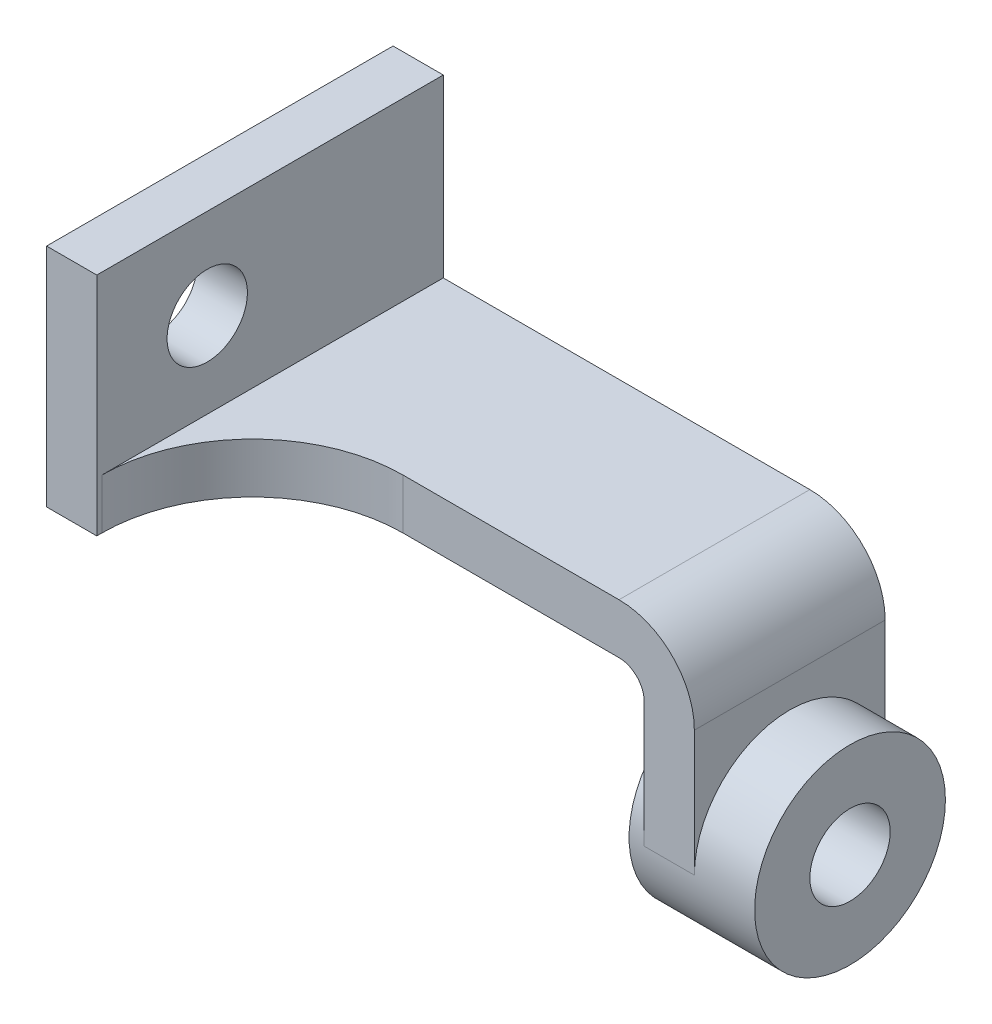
ISO-10303-21;
HEADER;
FILE_DESCRIPTION(('STEP AP214'),'2;1');
FILE_NAME('part.step','',(''),(''),'','','');
FILE_SCHEMA(('AUTOMOTIVE_DESIGN { 1 0 10303 214 1 1 1 1 }'));
ENDSEC;
DATA;
#1=APPLICATION_CONTEXT('core data for automotive mechanical design processes');
#2=APPLICATION_PROTOCOL_DEFINITION('international standard','automotive_design',2000,#1);
#3=PRODUCT_CONTEXT('',#1,'mechanical');
#4=PRODUCT('Part','Part','',(#3));
#5=PRODUCT_RELATED_PRODUCT_CATEGORY('part','',(#4));
#6=PRODUCT_DEFINITION_FORMATION('','',#4);
#7=PRODUCT_DEFINITION_CONTEXT('part definition',#1,'design');
#8=PRODUCT_DEFINITION('design','',#6,#7);
#9=PRODUCT_DEFINITION_SHAPE('','',#8);
#10=(LENGTH_UNIT() NAMED_UNIT(*) SI_UNIT(.MILLI.,.METRE.));
#11=(NAMED_UNIT(*) PLANE_ANGLE_UNIT() SI_UNIT($,.RADIAN.));
#12=(NAMED_UNIT(*) SI_UNIT($,.STERADIAN.) SOLID_ANGLE_UNIT());
#13=UNCERTAINTY_MEASURE_WITH_UNIT(LENGTH_MEASURE(1.E-05),#10,'distance_accuracy_value','');
#14=(GEOMETRIC_REPRESENTATION_CONTEXT(3) GLOBAL_UNCERTAINTY_ASSIGNED_CONTEXT((#13)) GLOBAL_UNIT_ASSIGNED_CONTEXT((#10,
#11,#12)) REPRESENTATION_CONTEXT('',''));
#15=CARTESIAN_POINT('',(0.,0.,0.));
#16=DIRECTION('',(0.,0.,1.));
#17=DIRECTION('',(1.,0.,0.));
#18=AXIS2_PLACEMENT_3D('',#15,#16,#17);
#19=CARTESIAN_POINT('',(88.,-22.5,19.));
#20=DIRECTION('',(1.,0.,0.));
#21=DIRECTION('',(0.,0.,-1.));
#22=AXIS2_PLACEMENT_3D('',#19,#20,#21);
#23=PLANE('',#22);
#24=DIRECTION('',(0.,-1.,0.));
#25=VECTOR('',#24,1.);
#26=CARTESIAN_POINT('',(88.,-22.5,19.));
#27=LINE('',#26,#25);
#28=CARTESIAN_POINT('',(88.,-27.5,19.));
#29=VERTEX_POINT('',#28);
#30=CARTESIAN_POINT('',(88.,-52.5,19.));
#31=VERTEX_POINT('',#30);
#32=EDGE_CURVE('E114',#29,#31,#27,.T.);
#33=ORIENTED_EDGE('',*,*,#32,.F.);
#34=DIRECTION('',(0.,0.,-1.));
#35=VECTOR('',#34,1.);
#36=CARTESIAN_POINT('',(88.,-27.5,-19.));
#37=LINE('',#36,#35);
#38=CARTESIAN_POINT('',(88.,-27.5,-19.));
#39=VERTEX_POINT('',#38);
#40=EDGE_CURVE('E183',#29,#39,#37,.T.);
#41=ORIENTED_EDGE('',*,*,#40,.T.);
#42=DIRECTION('',(0.,-1.,0.));
#43=VECTOR('',#42,1.);
#44=CARTESIAN_POINT('',(88.,-22.5,-19.));
#45=LINE('',#44,#43);
#46=CARTESIAN_POINT('',(88.,-52.5,-19.));
#47=VERTEX_POINT('',#46);
#48=EDGE_CURVE('E136',#39,#47,#45,.T.);
#49=ORIENTED_EDGE('',*,*,#48,.T.);
#50=CARTESIAN_POINT('',(88.,-52.5,0.));
#51=DIRECTION('',(1.,0.,0.));
#52=DIRECTION('',(0.,0.,-1.));
#53=AXIS2_PLACEMENT_3D('',#50,#51,#52);
#54=CIRCLE('',#53,19.);
#55=EDGE_CURVE('E130',#31,#47,#54,.F.);
#56=ORIENTED_EDGE('',*,*,#55,.F.);
#57=EDGE_LOOP('',(#33,#41,#49,#56));
#58=FACE_BOUND('',#57,.T.);
#59=ADVANCED_FACE('F26',(#58),#23,.F.);
#60=CARTESIAN_POINT('',(98.,-12.5,19.));
#61=DIRECTION('',(-1.,0.,0.));
#62=DIRECTION('',(0.,0.,1.));
#63=AXIS2_PLACEMENT_3D('',#60,#61,#62);
#64=PLANE('',#63);
#65=DIRECTION('',(0.,1.,0.));
#66=VECTOR('',#65,1.);
#67=CARTESIAN_POINT('',(98.,-12.5,-19.));
#68=LINE('',#67,#66);
#69=CARTESIAN_POINT('',(98.,-52.5,-19.));
#70=VERTEX_POINT('',#69);
#71=CARTESIAN_POINT('',(98.,-27.5,-19.));
#72=VERTEX_POINT('',#71);
#73=EDGE_CURVE('E145',#70,#72,#68,.T.);
#74=ORIENTED_EDGE('',*,*,#73,.T.);
#75=DIRECTION('',(0.,0.,-1.));
#76=VECTOR('',#75,1.);
#77=CARTESIAN_POINT('',(98.,-27.5,19.));
#78=LINE('',#77,#76);
#79=CARTESIAN_POINT('',(98.,-27.5,19.));
#80=VERTEX_POINT('',#79);
#81=EDGE_CURVE('E179',#72,#80,#78,.F.);
#82=ORIENTED_EDGE('',*,*,#81,.T.);
#83=DIRECTION('',(0.,1.,0.));
#84=VECTOR('',#83,1.);
#85=CARTESIAN_POINT('',(98.,-12.5,19.));
#86=LINE('',#85,#84);
#87=CARTESIAN_POINT('',(98.,-52.5,19.));
#88=VERTEX_POINT('',#87);
#89=EDGE_CURVE('E134',#88,#80,#86,.T.);
#90=ORIENTED_EDGE('',*,*,#89,.F.);
#91=CARTESIAN_POINT('',(98.,-52.5,0.));
#92=DIRECTION('',(-1.,0.,0.));
#93=DIRECTION('',(0.,0.,1.));
#94=AXIS2_PLACEMENT_3D('',#91,#92,#93);
#95=CIRCLE('',#94,19.);
#96=EDGE_CURVE('E133',#70,#88,#95,.F.);
#97=ORIENTED_EDGE('',*,*,#96,.F.);
#98=EDGE_LOOP('',(#74,#82,#90,#97));
#99=FACE_BOUND('',#98,.T.);
#100=ADVANCED_FACE('F190',(#99),#64,.F.);
#101=CARTESIAN_POINT('',(10.,22.5,50.));
#102=DIRECTION('',(-1.,0.,0.));
#103=DIRECTION('',(0.,0.,1.));
#104=AXIS2_PLACEMENT_3D('',#101,#102,#103);
#105=PLANE('',#104);
#106=CARTESIAN_POINT('',(10.,4.5,28.));
#107=DIRECTION('',(1.,0.,0.));
#108=DIRECTION('',(0.,0.,-1.));
#109=AXIS2_PLACEMENT_3D('',#106,#107,#108);
#110=CIRCLE('',#109,8.);
#111=CARTESIAN_POINT('',(10.,4.5,20.));
#112=VERTEX_POINT('',#111);
#113=EDGE_CURVE('E388',#112,#112,#110,.T.);
#114=ORIENTED_EDGE('',*,*,#113,.F.);
#115=EDGE_LOOP('',(#114));
#116=FACE_BOUND('',#115,.T.);
#117=DIRECTION('',(0.,0.,-1.));
#118=VECTOR('',#117,1.);
#119=CARTESIAN_POINT('',(10.,-22.5,50.));
#120=LINE('',#119,#118);
#121=CARTESIAN_POINT('',(10.,-22.5,50.));
#122=VERTEX_POINT('',#121);
#123=CARTESIAN_POINT('',(10.,-22.5,49.));
#124=VERTEX_POINT('',#123);
#125=EDGE_CURVE('E207',#122,#124,#120,.T.);
#126=ORIENTED_EDGE('',*,*,#125,.T.);
#127=DIRECTION('',(0.,-1.,0.));
#128=VECTOR('',#127,1.);
#129=CARTESIAN_POINT('',(10.,-12.5,49.));
#130=LINE('',#129,#128);
#131=CARTESIAN_POINT('',(10.,-12.5,49.));
#132=VERTEX_POINT('',#131);
#133=EDGE_CURVE('E234',#124,#132,#130,.F.);
#134=ORIENTED_EDGE('',*,*,#133,.T.);
#135=DIRECTION('',(0.,0.,-1.));
#136=VECTOR('',#135,1.);
#137=CARTESIAN_POINT('',(10.,-12.5,19.));
#138=LINE('',#137,#136);
#139=CARTESIAN_POINT('',(10.,-12.5,-19.));
#140=VERTEX_POINT('',#139);
#141=EDGE_CURVE('E152',#132,#140,#138,.T.);
#142=ORIENTED_EDGE('',*,*,#141,.T.);
#143=DIRECTION('',(0.,1.,0.));
#144=VECTOR('',#143,1.);
#145=CARTESIAN_POINT('',(10.,-22.5,-19.));
#146=LINE('',#145,#144);
#147=CARTESIAN_POINT('',(10.,22.5,-19.));
#148=VERTEX_POINT('',#147);
#149=EDGE_CURVE('E161',#140,#148,#146,.T.);
#150=ORIENTED_EDGE('',*,*,#149,.T.);
#151=DIRECTION('',(0.,0.,1.));
#152=VECTOR('',#151,1.);
#153=CARTESIAN_POINT('',(10.,22.5,50.));
#154=LINE('',#153,#152);
#155=CARTESIAN_POINT('',(10.,22.5,50.));
#156=VERTEX_POINT('',#155);
#157=EDGE_CURVE('E206',#148,#156,#154,.T.);
#158=ORIENTED_EDGE('',*,*,#157,.T.);
#159=DIRECTION('',(0.,-1.,0.));
#160=VECTOR('',#159,1.);
#161=CARTESIAN_POINT('',(10.,-22.5,50.));
#162=LINE('',#161,#160);
#163=EDGE_CURVE('E211',#156,#122,#162,.T.);
#164=ORIENTED_EDGE('',*,*,#163,.T.);
#165=EDGE_LOOP('',(#126,#134,#142,#150,#158,#164));
#166=FACE_BOUND('',#165,.T.);
#167=ADVANCED_FACE('F259',(#116,#166),#105,.F.);
#168=CARTESIAN_POINT('',(10.,-22.5,50.));
#169=DIRECTION('',(0.,0.,-1.));
#170=DIRECTION('',(-1.,0.,0.));
#171=AXIS2_PLACEMENT_3D('',#168,#169,#170);
#172=PLANE('',#171);
#173=DIRECTION('',(0.,-1.,0.));
#174=VECTOR('',#173,1.);
#175=CARTESIAN_POINT('',(0.,-22.5,50.));
#176=LINE('',#175,#174);
#177=CARTESIAN_POINT('',(0.,22.5,50.));
#178=VERTEX_POINT('',#177);
#179=CARTESIAN_POINT('',(0.,-22.5,50.));
#180=VERTEX_POINT('',#179);
#181=EDGE_CURVE('E155',#178,#180,#176,.T.);
#182=ORIENTED_EDGE('',*,*,#181,.T.);
#183=DIRECTION('',(-1.,0.,0.));
#184=VECTOR('',#183,1.);
#185=CARTESIAN_POINT('',(10.,-22.5,50.));
#186=LINE('',#185,#184);
#187=EDGE_CURVE('E219',#122,#180,#186,.T.);
#188=ORIENTED_EDGE('',*,*,#187,.F.);
#189=ORIENTED_EDGE('',*,*,#163,.F.);
#190=DIRECTION('',(-1.,0.,0.));
#191=VECTOR('',#190,1.);
#192=CARTESIAN_POINT('',(10.,22.5,50.));
#193=LINE('',#192,#191);
#194=EDGE_CURVE('E208',#156,#178,#193,.T.);
#195=ORIENTED_EDGE('',*,*,#194,.T.);
#196=EDGE_LOOP('',(#182,#188,#189,#195));
#197=FACE_BOUND('',#196,.T.);
#198=ADVANCED_FACE('F28',(#197),#172,.F.);
#199=CARTESIAN_POINT('',(10.,-22.5,50.));
#200=DIRECTION('',(0.,1.,0.));
#201=DIRECTION('',(0.,0.,1.));
#202=AXIS2_PLACEMENT_3D('',#199,#200,#201);
#203=PLANE('',#202);
#204=DIRECTION('',(-1.,0.,0.));
#205=VECTOR('',#204,1.);
#206=CARTESIAN_POINT('',(10.,-22.5,-19.));
#207=LINE('',#206,#205);
#208=CARTESIAN_POINT('',(83.,-22.5,-19.));
#209=VERTEX_POINT('',#208);
#210=CARTESIAN_POINT('',(0.,-22.5,-19.));
#211=VERTEX_POINT('',#210);
#212=EDGE_CURVE('E227',#209,#211,#207,.T.);
#213=ORIENTED_EDGE('',*,*,#212,.F.);
#214=DIRECTION('',(0.,0.,-1.));
#215=VECTOR('',#214,1.);
#216=CARTESIAN_POINT('',(83.,-22.5,19.));
#217=LINE('',#216,#215);
#218=CARTESIAN_POINT('',(83.,-22.5,19.));
#219=VERTEX_POINT('',#218);
#220=EDGE_CURVE('E41',#209,#219,#217,.F.);
#221=ORIENTED_EDGE('',*,*,#220,.T.);
#222=DIRECTION('',(1.,0.,0.));
#223=VECTOR('',#222,1.);
#224=CARTESIAN_POINT('',(10.,-22.5,19.));
#225=LINE('',#224,#223);
#226=CARTESIAN_POINT('',(40.,-22.5,19.));
#227=VERTEX_POINT('',#226);
#228=EDGE_CURVE('E125',#227,#219,#225,.T.);
#229=ORIENTED_EDGE('',*,*,#228,.F.);
#230=CARTESIAN_POINT('',(40.,-22.5,49.));
#231=DIRECTION('',(0.,1.,0.));
#232=DIRECTION('',(0.,0.,1.));
#233=AXIS2_PLACEMENT_3D('',#230,#231,#232);
#234=CIRCLE('',#233,30.);
#235=EDGE_CURVE('E237',#227,#124,#234,.T.);
#236=ORIENTED_EDGE('',*,*,#235,.T.);
#237=ORIENTED_EDGE('',*,*,#125,.F.);
#238=ORIENTED_EDGE('',*,*,#187,.T.);
#239=DIRECTION('',(0.,0.,-1.));
#240=VECTOR('',#239,1.);
#241=CARTESIAN_POINT('',(0.,-22.5,50.));
#242=LINE('',#241,#240);
#243=EDGE_CURVE('E286',#180,#211,#242,.T.);
#244=ORIENTED_EDGE('',*,*,#243,.T.);
#245=EDGE_LOOP('',(#213,#221,#229,#236,#237,#238,#244));
#246=FACE_BOUND('',#245,.T.);
#247=ADVANCED_FACE('F243',(#246),#203,.F.);
#248=CARTESIAN_POINT('',(10.,-22.5,-19.));
#249=DIRECTION('',(0.,0.,1.));
#250=DIRECTION('',(1.,0.,0.));
#251=AXIS2_PLACEMENT_3D('',#248,#249,#250);
#252=PLANE('',#251);
#253=DIRECTION('',(-1.,0.,0.));
#254=VECTOR('',#253,1.);
#255=CARTESIAN_POINT('',(10.,-12.5,-19.));
#256=LINE('',#255,#254);
#257=CARTESIAN_POINT('',(83.,-12.5,-19.));
#258=VERTEX_POINT('',#257);
#259=EDGE_CURVE('E147',#258,#140,#256,.T.);
#260=ORIENTED_EDGE('',*,*,#259,.F.);
#261=CARTESIAN_POINT('',(83.,-27.5,-19.));
#262=DIRECTION('',(0.,0.,1.));
#263=DIRECTION('',(1.,0.,0.));
#264=AXIS2_PLACEMENT_3D('',#261,#262,#263);
#265=CIRCLE('',#264,15.);
#266=EDGE_CURVE('E176',#258,#72,#265,.F.);
#267=ORIENTED_EDGE('',*,*,#266,.T.);
#268=ORIENTED_EDGE('',*,*,#73,.F.);
#269=DIRECTION('',(1.,0.,0.));
#270=VECTOR('',#269,1.);
#271=CARTESIAN_POINT('',(98.,-52.5,-19.));
#272=LINE('',#271,#270);
#273=EDGE_CURVE('E138',#47,#70,#272,.T.);
#274=ORIENTED_EDGE('',*,*,#273,.F.);
#275=ORIENTED_EDGE('',*,*,#48,.F.);
#276=CARTESIAN_POINT('',(83.,-27.5,-19.));
#277=DIRECTION('',(0.,0.,1.));
#278=DIRECTION('',(1.,0.,0.));
#279=AXIS2_PLACEMENT_3D('',#276,#277,#278);
#280=CIRCLE('',#279,5.);
#281=EDGE_CURVE('E34',#39,#209,#280,.T.);
#282=ORIENTED_EDGE('',*,*,#281,.T.);
#283=ORIENTED_EDGE('',*,*,#212,.T.);
#284=DIRECTION('',(0.,1.,0.));
#285=VECTOR('',#284,1.);
#286=CARTESIAN_POINT('',(0.,-22.5,-19.));
#287=LINE('',#286,#285);
#288=CARTESIAN_POINT('',(0.,22.5,-19.));
#289=VERTEX_POINT('',#288);
#290=EDGE_CURVE('E287',#211,#289,#287,.T.);
#291=ORIENTED_EDGE('',*,*,#290,.T.);
#292=DIRECTION('',(-1.,0.,0.));
#293=VECTOR('',#292,1.);
#294=CARTESIAN_POINT('',(10.,22.5,-19.));
#295=LINE('',#294,#293);
#296=EDGE_CURVE('E203',#148,#289,#295,.T.);
#297=ORIENTED_EDGE('',*,*,#296,.F.);
#298=ORIENTED_EDGE('',*,*,#149,.F.);
#299=EDGE_LOOP('',(#260,#267,#268,#274,#275,#282,#283,#291,#297,#298));
#300=FACE_BOUND('',#299,.T.);
#301=ADVANCED_FACE('F187',(#300),#252,.F.);
#302=CARTESIAN_POINT('',(10.,22.5,50.));
#303=DIRECTION('',(0.,-1.,0.));
#304=DIRECTION('',(0.,0.,-1.));
#305=AXIS2_PLACEMENT_3D('',#302,#303,#304);
#306=PLANE('',#305);
#307=DIRECTION('',(0.,0.,1.));
#308=VECTOR('',#307,1.);
#309=CARTESIAN_POINT('',(0.,22.5,50.));
#310=LINE('',#309,#308);
#311=EDGE_CURVE('E215',#289,#178,#310,.T.);
#312=ORIENTED_EDGE('',*,*,#311,.T.);
#313=ORIENTED_EDGE('',*,*,#194,.F.);
#314=ORIENTED_EDGE('',*,*,#157,.F.);
#315=ORIENTED_EDGE('',*,*,#296,.T.);
#316=EDGE_LOOP('',(#312,#313,#314,#315));
#317=FACE_BOUND('',#316,.T.);
#318=ADVANCED_FACE('F266',(#317),#306,.F.);
#319=CARTESIAN_POINT('',(0.,22.5,50.));
#320=DIRECTION('',(-1.,0.,0.));
#321=DIRECTION('',(0.,0.,1.));
#322=AXIS2_PLACEMENT_3D('',#319,#320,#321);
#323=PLANE('',#322);
#324=CARTESIAN_POINT('',(0.,4.5,28.));
#325=DIRECTION('',(1.,0.,0.));
#326=DIRECTION('',(0.,0.,-1.));
#327=AXIS2_PLACEMENT_3D('',#324,#325,#326);
#328=CIRCLE('',#327,8.);
#329=CARTESIAN_POINT('',(0.,4.5,20.));
#330=VERTEX_POINT('',#329);
#331=EDGE_CURVE('E385',#330,#330,#328,.T.);
#332=ORIENTED_EDGE('',*,*,#331,.T.);
#333=EDGE_LOOP('',(#332));
#334=FACE_BOUND('',#333,.T.);
#335=ORIENTED_EDGE('',*,*,#181,.F.);
#336=ORIENTED_EDGE('',*,*,#311,.F.);
#337=ORIENTED_EDGE('',*,*,#290,.F.);
#338=ORIENTED_EDGE('',*,*,#243,.F.);
#339=EDGE_LOOP('',(#335,#336,#337,#338));
#340=FACE_BOUND('',#339,.T.);
#341=ADVANCED_FACE('F263',(#334,#340),#323,.T.);
#342=CARTESIAN_POINT('',(10.,-12.5,19.));
#343=DIRECTION('',(0.,-1.,0.));
#344=DIRECTION('',(0.,0.,-1.));
#345=AXIS2_PLACEMENT_3D('',#342,#343,#344);
#346=PLANE('',#345);
#347=DIRECTION('',(-1.,0.,0.));
#348=VECTOR('',#347,1.);
#349=CARTESIAN_POINT('',(10.,-12.5,19.));
#350=LINE('',#349,#348);
#351=CARTESIAN_POINT('',(83.,-12.5,19.));
#352=VERTEX_POINT('',#351);
#353=CARTESIAN_POINT('',(40.,-12.5,19.));
#354=VERTEX_POINT('',#353);
#355=EDGE_CURVE('E150',#352,#354,#350,.T.);
#356=ORIENTED_EDGE('',*,*,#355,.F.);
#357=DIRECTION('',(0.,0.,-1.));
#358=VECTOR('',#357,1.);
#359=CARTESIAN_POINT('',(83.,-12.5,19.));
#360=LINE('',#359,#358);
#361=EDGE_CURVE('E173',#352,#258,#360,.T.);
#362=ORIENTED_EDGE('',*,*,#361,.T.);
#363=ORIENTED_EDGE('',*,*,#259,.T.);
#364=ORIENTED_EDGE('',*,*,#141,.F.);
#365=CARTESIAN_POINT('',(40.,-12.5,49.));
#366=DIRECTION('',(0.,-1.,0.));
#367=DIRECTION('',(0.,0.,-1.));
#368=AXIS2_PLACEMENT_3D('',#365,#366,#367);
#369=CIRCLE('',#368,30.);
#370=EDGE_CURVE('E177',#132,#354,#369,.T.);
#371=ORIENTED_EDGE('',*,*,#370,.T.);
#372=EDGE_LOOP('',(#356,#362,#363,#364,#371));
#373=FACE_BOUND('',#372,.T.);
#374=ADVANCED_FACE('F198',(#373),#346,.F.);
#375=CARTESIAN_POINT('',(88.,-22.5,19.));
#376=DIRECTION('',(0.,0.,-1.));
#377=DIRECTION('',(-1.,0.,0.));
#378=AXIS2_PLACEMENT_3D('',#375,#376,#377);
#379=PLANE('',#378);
#380=ORIENTED_EDGE('',*,*,#89,.T.);
#381=CARTESIAN_POINT('',(83.,-27.5,19.));
#382=DIRECTION('',(0.,0.,-1.));
#383=DIRECTION('',(-1.,0.,0.));
#384=AXIS2_PLACEMENT_3D('',#381,#382,#383);
#385=CIRCLE('',#384,15.);
#386=EDGE_CURVE('E181',#80,#352,#385,.F.);
#387=ORIENTED_EDGE('',*,*,#386,.T.);
#388=ORIENTED_EDGE('',*,*,#355,.T.);
#389=DIRECTION('',(0.,-1.,0.));
#390=VECTOR('',#389,1.);
#391=CARTESIAN_POINT('',(40.,-22.5,19.));
#392=LINE('',#391,#390);
#393=EDGE_CURVE('E230',#354,#227,#392,.T.);
#394=ORIENTED_EDGE('',*,*,#393,.T.);
#395=ORIENTED_EDGE('',*,*,#228,.T.);
#396=CARTESIAN_POINT('',(83.,-27.5,19.));
#397=DIRECTION('',(0.,0.,-1.));
#398=DIRECTION('',(-1.,0.,0.));
#399=AXIS2_PLACEMENT_3D('',#396,#397,#398);
#400=CIRCLE('',#399,5.);
#401=EDGE_CURVE('E11',#219,#29,#400,.T.);
#402=ORIENTED_EDGE('',*,*,#401,.T.);
#403=ORIENTED_EDGE('',*,*,#32,.T.);
#404=DIRECTION('',(1.,0.,0.));
#405=VECTOR('',#404,1.);
#406=CARTESIAN_POINT('',(98.,-52.5,19.));
#407=LINE('',#406,#405);
#408=EDGE_CURVE('E118',#31,#88,#407,.T.);
#409=ORIENTED_EDGE('',*,*,#408,.T.);
#410=EDGE_LOOP('',(#380,#387,#388,#394,#395,#402,#403,#409));
#411=FACE_BOUND('',#410,.T.);
#412=ADVANCED_FACE('F117',(#411),#379,.F.);
#413=CARTESIAN_POINT('',(40.,-22.5,49.));
#414=DIRECTION('',(0.,1.,0.));
#415=DIRECTION('',(0.,0.,1.));
#416=AXIS2_PLACEMENT_3D('',#413,#414,#415);
#417=CYLINDRICAL_SURFACE('',#416,30.);
#418=ORIENTED_EDGE('',*,*,#370,.F.);
#419=ORIENTED_EDGE('',*,*,#133,.F.);
#420=ORIENTED_EDGE('',*,*,#235,.F.);
#421=ORIENTED_EDGE('',*,*,#393,.F.);
#422=EDGE_LOOP('',(#418,#419,#420,#421));
#423=FACE_BOUND('',#422,.T.);
#424=ADVANCED_FACE('F242',(#423),#417,.F.);
#425=CARTESIAN_POINT('',(110.,-52.5,0.));
#426=DIRECTION('',(-1.,0.,0.));
#427=DIRECTION('',(0.,0.,1.));
#428=AXIS2_PLACEMENT_3D('',#425,#426,#427);
#429=CYLINDRICAL_SURFACE('',#428,19.);
#430=CARTESIAN_POINT('',(85.,-52.5,0.));
#431=DIRECTION('',(1.,0.,0.));
#432=DIRECTION('',(0.,0.,-1.));
#433=AXIS2_PLACEMENT_3D('',#430,#431,#432);
#434=CIRCLE('',#433,19.);
#435=CARTESIAN_POINT('',(85.,-52.5,-19.));
#436=VERTEX_POINT('',#435);
#437=EDGE_CURVE('E395',#436,#436,#434,.T.);
#438=ORIENTED_EDGE('',*,*,#437,.T.);
#439=EDGE_LOOP('',(#438));
#440=FACE_BOUND('',#439,.T.);
#441=CARTESIAN_POINT('',(110.,-52.5,0.));
#442=DIRECTION('',(1.,0.,0.));
#443=DIRECTION('',(0.,0.,-1.));
#444=AXIS2_PLACEMENT_3D('',#441,#442,#443);
#445=CIRCLE('',#444,19.);
#446=CARTESIAN_POINT('',(110.,-52.5,-19.));
#447=VERTEX_POINT('',#446);
#448=EDGE_CURVE('E140',#447,#447,#445,.T.);
#449=ORIENTED_EDGE('',*,*,#448,.F.);
#450=EDGE_LOOP('',(#449));
#451=FACE_BOUND('',#450,.T.);
#452=ORIENTED_EDGE('',*,*,#408,.F.);
#453=ORIENTED_EDGE('',*,*,#55,.T.);
#454=ORIENTED_EDGE('',*,*,#273,.T.);
#455=ORIENTED_EDGE('',*,*,#96,.T.);
#456=EDGE_LOOP('',(#452,#453,#454,#455));
#457=FACE_BOUND('',#456,.T.);
#458=ADVANCED_FACE('F129',(#440,#451,#457),#429,.T.);
#459=CARTESIAN_POINT('',(110.,-52.5,0.));
#460=DIRECTION('',(1.,0.,0.));
#461=DIRECTION('',(0.,0.,-1.));
#462=AXIS2_PLACEMENT_3D('',#459,#460,#461);
#463=PLANE('',#462);
#464=CARTESIAN_POINT('',(110.,-52.5,0.));
#465=DIRECTION('',(1.,0.,0.));
#466=DIRECTION('',(0.,0.,-1.));
#467=AXIS2_PLACEMENT_3D('',#464,#465,#466);
#468=CIRCLE('',#467,8.);
#469=CARTESIAN_POINT('',(110.,-52.5,-8.));
#470=VERTEX_POINT('',#469);
#471=EDGE_CURVE('E390',#470,#470,#468,.T.);
#472=ORIENTED_EDGE('',*,*,#471,.F.);
#473=EDGE_LOOP('',(#472));
#474=FACE_BOUND('',#473,.T.);
#475=ORIENTED_EDGE('',*,*,#448,.T.);
#476=EDGE_LOOP('',(#475));
#477=FACE_BOUND('',#476,.T.);
#478=ADVANCED_FACE('F311',(#474,#477),#463,.T.);
#479=CARTESIAN_POINT('',(85.,-52.5,0.));
#480=DIRECTION('',(1.,0.,0.));
#481=DIRECTION('',(0.,0.,-1.));
#482=AXIS2_PLACEMENT_3D('',#479,#480,#481);
#483=PLANE('',#482);
#484=CARTESIAN_POINT('',(85.,-52.5,0.));
#485=DIRECTION('',(1.,0.,0.));
#486=DIRECTION('',(0.,0.,-1.));
#487=AXIS2_PLACEMENT_3D('',#484,#485,#486);
#488=CIRCLE('',#487,8.);
#489=CARTESIAN_POINT('',(85.,-52.5,-8.));
#490=VERTEX_POINT('',#489);
#491=EDGE_CURVE('E171',#490,#490,#488,.T.);
#492=ORIENTED_EDGE('',*,*,#491,.T.);
#493=EDGE_LOOP('',(#492));
#494=FACE_BOUND('',#493,.T.);
#495=ORIENTED_EDGE('',*,*,#437,.F.);
#496=EDGE_LOOP('',(#495));
#497=FACE_BOUND('',#496,.T.);
#498=ADVANCED_FACE('F319',(#494,#497),#483,.F.);
#499=CARTESIAN_POINT('',(0.,-52.5,0.));
#500=DIRECTION('',(1.,0.,0.));
#501=DIRECTION('',(0.,0.,-1.));
#502=AXIS2_PLACEMENT_3D('',#499,#500,#501);
#503=CYLINDRICAL_SURFACE('',#502,8.);
#504=ORIENTED_EDGE('',*,*,#471,.T.);
#505=EDGE_LOOP('',(#504));
#506=FACE_BOUND('',#505,.T.);
#507=ORIENTED_EDGE('',*,*,#491,.F.);
#508=EDGE_LOOP('',(#507));
#509=FACE_BOUND('',#508,.T.);
#510=ADVANCED_FACE('F327',(#506,#509),#503,.F.);
#511=CARTESIAN_POINT('',(0.,4.5,28.));
#512=DIRECTION('',(1.,0.,0.));
#513=DIRECTION('',(0.,0.,-1.));
#514=AXIS2_PLACEMENT_3D('',#511,#512,#513);
#515=CYLINDRICAL_SURFACE('',#514,8.);
#516=ORIENTED_EDGE('',*,*,#331,.F.);
#517=EDGE_LOOP('',(#516));
#518=FACE_BOUND('',#517,.T.);
#519=ORIENTED_EDGE('',*,*,#113,.T.);
#520=EDGE_LOOP('',(#519));
#521=FACE_BOUND('',#520,.T.);
#522=ADVANCED_FACE('F251',(#518,#521),#515,.F.);
#523=CARTESIAN_POINT('',(83.,-27.5,19.));
#524=DIRECTION('',(0.,0.,-1.));
#525=DIRECTION('',(-1.,0.,0.));
#526=AXIS2_PLACEMENT_3D('',#523,#524,#525);
#527=CYLINDRICAL_SURFACE('',#526,15.);
#528=ORIENTED_EDGE('',*,*,#386,.F.);
#529=ORIENTED_EDGE('',*,*,#81,.F.);
#530=ORIENTED_EDGE('',*,*,#266,.F.);
#531=ORIENTED_EDGE('',*,*,#361,.F.);
#532=EDGE_LOOP('',(#528,#529,#530,#531));
#533=FACE_BOUND('',#532,.T.);
#534=ADVANCED_FACE('F196',(#533),#527,.T.);
#535=CARTESIAN_POINT('',(83.,-27.5,19.));
#536=DIRECTION('',(0.,0.,1.));
#537=DIRECTION('',(1.,0.,0.));
#538=AXIS2_PLACEMENT_3D('',#535,#536,#537);
#539=CYLINDRICAL_SURFACE('',#538,5.);
#540=ORIENTED_EDGE('',*,*,#401,.F.);
#541=ORIENTED_EDGE('',*,*,#220,.F.);
#542=ORIENTED_EDGE('',*,*,#281,.F.);
#543=ORIENTED_EDGE('',*,*,#40,.F.);
#544=EDGE_LOOP('',(#540,#541,#542,#543));
#545=FACE_BOUND('',#544,.T.);
#546=ADVANCED_FACE('F244',(#545),#539,.F.);
#547=CLOSED_SHELL('',(#59,#100,#167,#198,#247,#301,#318,#341,#374,#412,#424,#458,#478,#498,#510,
#522,#534,#546));
#548=MANIFOLD_SOLID_BREP('B2',#547);
#549=ADVANCED_BREP_SHAPE_REPRESENTATION('',(#18,#548),#14);
#550=SHAPE_DEFINITION_REPRESENTATION(#9,#549);
ENDSEC;
END-ISO-10303-21;
